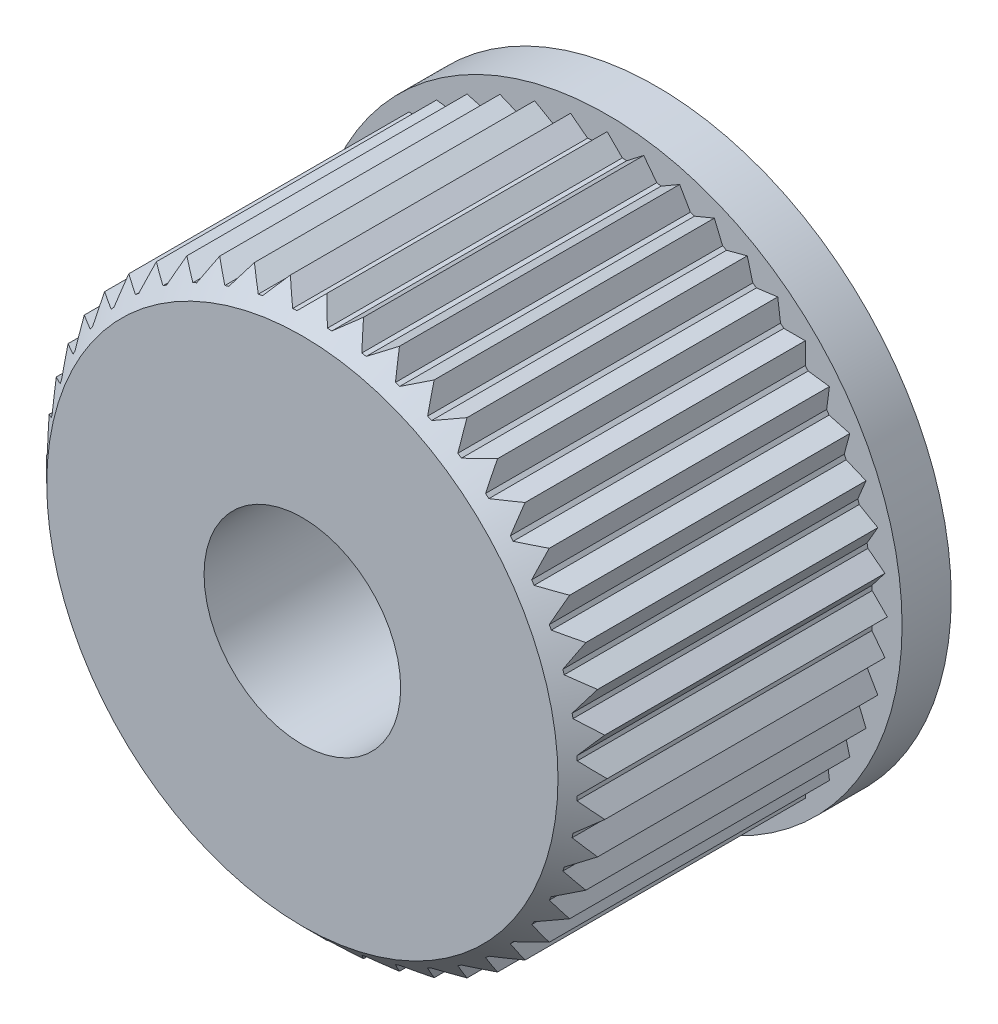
from build123d import *

# Parameters (mm, degrees)
ESQUISSE1_R             = 3
BOSS_EXTRU_1_DEPTH      = 0.5
BOSS_EXTRU_2_DEPTH      = 3.6
ESQUISSE3_R             = 1
ENL_V_MAT_EXTRU_1_DEPTH = 6.564171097


with BuildPart() as part:
    # Esquisse1 → Boss.-Extru.1 (new body)
    with BuildSketch(Plane.XY):
        Circle(ESQUISSE1_R)
    extrude(amount=BOSS_EXTRU_1_DEPTH)

    # Esquisse2 → Boss.-Extru.2 (add)
    with BuildSketch(Plane.XY):
        with BuildLine():
            Line((0, 2.85), (-0.154419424, 2.695580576))
            ThreePointArc((-0.154419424, 2.695580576), (-0.176588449, 2.694219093), (-0.198745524, 2.69267529))
            Line((-0.198745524, 2.69267529), (-0.371999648, 2.825617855))
            Line((-0.371999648, 2.825617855), (-0.504942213, 2.652363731))
            ThreePointArc((-0.504942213, 2.652363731), (-0.526743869, 2.648120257), (-0.548509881, 2.643697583))
            Line((-0.548509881, 2.643697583), (-0.737634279, 2.752888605))
            Line((-0.737634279, 2.752888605), (-0.8468253, 2.563764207))
            ThreePointArc((-0.8468253, 2.563764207), (-0.867886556, 2.55671135), (-0.888889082, 2.549485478))
            Line((-0.888889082, 2.549485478), (-1.090647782, 2.633056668))
            Line((-1.090647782, 2.633056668), (-1.174218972, 2.431297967))
            ThreePointArc((-1.174218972, 2.431297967), (-1.194179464, 2.421556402), (-1.214059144, 2.411650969))
            Line((-1.214059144, 2.411650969), (-1.425, 2.468172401))
            Line((-1.425, 2.468172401), (-1.481521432, 2.257231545))
            ThreePointArc((-1.481521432, 2.257231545), (-1.500039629, 2.244967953), (-1.518456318, 2.232552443))
            Line((-1.518456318, 2.232552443), (-1.734970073, 2.26105702))
            Line((-1.734970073, 2.26105702), (-1.763474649, 2.044543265))
            ThreePointArc((-1.763474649, 2.044543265), (-1.780233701, 2.02996748), (-1.796872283, 2.015254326))
            Line((-1.796872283, 2.015254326), (-2.015254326, 2.015254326))
            Line((-2.015254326, 2.015254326), (-2.015254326, 1.796872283))
            ThreePointArc((-2.015254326, 1.796872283), (-2.02996748, 1.780233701), (-2.044543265, 1.763474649))
            Line((-2.044543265, 1.763474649), (-2.26105702, 1.734970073))
            Line((-2.26105702, 1.734970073), (-2.232552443, 1.518456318))
            ThreePointArc((-2.232552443, 1.518456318), (-2.244967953, 1.500039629), (-2.257231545, 1.481521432))
            Line((-2.257231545, 1.481521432), (-2.468172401, 1.425))
            Line((-2.468172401, 1.425), (-2.411650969, 1.214059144))
            ThreePointArc((-2.411650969, 1.214059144), (-2.421556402, 1.194179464), (-2.431297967, 1.174218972))
            Line((-2.431297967, 1.174218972), (-2.633056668, 1.090647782))
            Line((-2.633056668, 1.090647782), (-2.549485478, 0.888889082))
            ThreePointArc((-2.549485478, 0.888889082), (-2.55671135, 0.867886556), (-2.563764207, 0.8468253))
            Line((-2.563764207, 0.8468253), (-2.752888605, 0.737634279))
            Line((-2.752888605, 0.737634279), (-2.643697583, 0.548509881))
            ThreePointArc((-2.643697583, 0.548509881), (-2.648120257, 0.526743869), (-2.652363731, 0.504942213))
            Line((-2.652363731, 0.504942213), (-2.825617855, 0.371999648))
            Line((-2.825617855, 0.371999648), (-2.69267529, 0.198745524))
            ThreePointArc((-2.69267529, 0.198745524), (-2.694219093, 0.176588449), (-2.695580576, 0.154419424))
            Line((-2.695580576, 0.154419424), (-2.85, 0))
            Line((-2.85, 0), (-2.695580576, -0.154419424))
            ThreePointArc((-2.695580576, -0.154419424), (-2.694219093, -0.176588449), (-2.69267529, -0.198745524))
            Line((-2.69267529, -0.198745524), (-2.825617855, -0.371999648))
            Line((-2.825617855, -0.371999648), (-2.652363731, -0.504942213))
            ThreePointArc((-2.652363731, -0.504942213), (-2.648120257, -0.526743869), (-2.643697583, -0.548509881))
            Line((-2.643697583, -0.548509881), (-2.752888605, -0.737634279))
            Line((-2.752888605, -0.737634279), (-2.563764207, -0.8468253))
            ThreePointArc((-2.563764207, -0.8468253), (-2.55671135, -0.867886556), (-2.549485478, -0.888889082))
            Line((-2.549485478, -0.888889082), (-2.633056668, -1.090647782))
            Line((-2.633056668, -1.090647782), (-2.431297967, -1.174218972))
            ThreePointArc((-2.431297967, -1.174218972), (-2.421556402, -1.194179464), (-2.411650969, -1.214059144))
            Line((-2.411650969, -1.214059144), (-2.468172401, -1.425))
            Line((-2.468172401, -1.425), (-2.257231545, -1.481521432))
            ThreePointArc((-2.257231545, -1.481521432), (-2.244967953, -1.500039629), (-2.232552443, -1.518456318))
            Line((-2.232552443, -1.518456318), (-2.26105702, -1.734970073))
            Line((-2.26105702, -1.734970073), (-2.044543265, -1.763474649))
            ThreePointArc((-2.044543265, -1.763474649), (-2.02996748, -1.780233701), (-2.015254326, -1.796872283))
            Line((-2.015254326, -1.796872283), (-2.015254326, -2.015254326))
            Line((-2.015254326, -2.015254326), (-1.796872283, -2.015254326))
            ThreePointArc((-1.796872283, -2.015254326), (-1.780233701, -2.02996748), (-1.763474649, -2.044543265))
            Line((-1.763474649, -2.044543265), (-1.734970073, -2.26105702))
            Line((-1.734970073, -2.26105702), (-1.518456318, -2.232552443))
            ThreePointArc((-1.518456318, -2.232552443), (-1.500039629, -2.244967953), (-1.481521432, -2.257231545))
            Line((-1.481521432, -2.257231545), (-1.425, -2.468172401))
            Line((-1.425, -2.468172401), (-1.214059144, -2.411650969))
            ThreePointArc((-1.214059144, -2.411650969), (-1.194179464, -2.421556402), (-1.174218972, -2.431297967))
            Line((-1.174218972, -2.431297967), (-1.090647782, -2.633056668))
            Line((-1.090647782, -2.633056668), (-0.888889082, -2.549485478))
            ThreePointArc((-0.888889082, -2.549485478), (-0.867886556, -2.55671135), (-0.8468253, -2.563764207))
            Line((-0.8468253, -2.563764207), (-0.737634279, -2.752888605))
            Line((-0.737634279, -2.752888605), (-0.548509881, -2.643697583))
            ThreePointArc((-0.548509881, -2.643697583), (-0.526743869, -2.648120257), (-0.504942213, -2.652363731))
            Line((-0.504942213, -2.652363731), (-0.371999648, -2.825617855))
            Line((-0.371999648, -2.825617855), (-0.198745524, -2.69267529))
            ThreePointArc((-0.198745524, -2.69267529), (-0.176588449, -2.694219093), (-0.154419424, -2.695580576))
            Line((-0.154419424, -2.695580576), (0, -2.85))
            Line((0, -2.85), (0.154419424, -2.695580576))
            ThreePointArc((0.154419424, -2.695580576), (0.176588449, -2.694219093), (0.198745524, -2.69267529))
            Line((0.198745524, -2.69267529), (0.371999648, -2.825617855))
            Line((0.371999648, -2.825617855), (0.504942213, -2.652363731))
            ThreePointArc((0.504942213, -2.652363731), (0.526743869, -2.648120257), (0.548509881, -2.643697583))
            Line((0.548509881, -2.643697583), (0.737634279, -2.752888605))
            Line((0.737634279, -2.752888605), (0.8468253, -2.563764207))
            ThreePointArc((0.8468253, -2.563764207), (0.867886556, -2.55671135), (0.888889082, -2.549485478))
            Line((0.888889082, -2.549485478), (1.090647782, -2.633056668))
            Line((1.090647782, -2.633056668), (1.174218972, -2.431297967))
            ThreePointArc((1.174218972, -2.431297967), (1.194179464, -2.421556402), (1.214059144, -2.411650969))
            Line((1.214059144, -2.411650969), (1.425, -2.468172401))
            Line((1.425, -2.468172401), (1.481521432, -2.257231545))
            ThreePointArc((1.481521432, -2.257231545), (1.500039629, -2.244967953), (1.518456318, -2.232552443))
            Line((1.518456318, -2.232552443), (1.734970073, -2.26105702))
            Line((1.734970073, -2.26105702), (1.763474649, -2.044543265))
            ThreePointArc((1.763474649, -2.044543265), (1.780233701, -2.02996748), (1.796872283, -2.015254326))
            Line((1.796872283, -2.015254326), (2.015254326, -2.015254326))
            Line((2.015254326, -2.015254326), (2.015254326, -1.796872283))
            ThreePointArc((2.015254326, -1.796872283), (2.02996748, -1.780233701), (2.044543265, -1.763474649))
            Line((2.044543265, -1.763474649), (2.26105702, -1.734970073))
            Line((2.26105702, -1.734970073), (2.232552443, -1.518456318))
            ThreePointArc((2.232552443, -1.518456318), (2.244967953, -1.500039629), (2.257231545, -1.481521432))
            Line((2.257231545, -1.481521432), (2.468172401, -1.425))
            Line((2.468172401, -1.425), (2.411650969, -1.214059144))
            ThreePointArc((2.411650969, -1.214059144), (2.421556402, -1.194179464), (2.431297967, -1.174218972))
            Line((2.431297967, -1.174218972), (2.633056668, -1.090647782))
            Line((2.633056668, -1.090647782), (2.549485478, -0.888889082))
            ThreePointArc((2.549485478, -0.888889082), (2.55671135, -0.867886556), (2.563764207, -0.8468253))
            Line((2.563764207, -0.8468253), (2.752888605, -0.737634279))
            Line((2.752888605, -0.737634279), (2.643697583, -0.548509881))
            ThreePointArc((2.643697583, -0.548509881), (2.648120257, -0.526743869), (2.652363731, -0.504942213))
            Line((2.652363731, -0.504942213), (2.825617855, -0.371999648))
            Line((2.825617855, -0.371999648), (2.69267529, -0.198745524))
            ThreePointArc((2.69267529, -0.198745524), (2.694219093, -0.176588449), (2.695580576, -0.154419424))
            Line((2.695580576, -0.154419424), (2.85, 0))
            Line((2.85, 0), (2.695580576, 0.154419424))
            ThreePointArc((2.695580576, 0.154419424), (2.694219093, 0.176588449), (2.69267529, 0.198745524))
            Line((2.69267529, 0.198745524), (2.825617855, 0.371999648))
            Line((2.825617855, 0.371999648), (2.652363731, 0.504942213))
            ThreePointArc((2.652363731, 0.504942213), (2.648120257, 0.526743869), (2.643697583, 0.548509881))
            Line((2.643697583, 0.548509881), (2.752888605, 0.737634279))
            Line((2.752888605, 0.737634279), (2.563764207, 0.8468253))
            ThreePointArc((2.563764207, 0.8468253), (2.55671135, 0.867886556), (2.549485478, 0.888889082))
            Line((2.549485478, 0.888889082), (2.633056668, 1.090647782))
            Line((2.633056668, 1.090647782), (2.431297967, 1.174218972))
            ThreePointArc((2.431297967, 1.174218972), (2.421556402, 1.194179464), (2.411650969, 1.214059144))
            Line((2.411650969, 1.214059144), (2.468172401, 1.425))
            Line((2.468172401, 1.425), (2.257231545, 1.481521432))
            ThreePointArc((2.257231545, 1.481521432), (2.244967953, 1.500039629), (2.232552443, 1.518456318))
            Line((2.232552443, 1.518456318), (2.26105702, 1.734970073))
            Line((2.26105702, 1.734970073), (2.044543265, 1.763474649))
            ThreePointArc((2.044543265, 1.763474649), (2.02996748, 1.780233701), (2.015254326, 1.796872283))
            Line((2.015254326, 1.796872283), (2.015254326, 2.015254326))
            Line((2.015254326, 2.015254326), (1.796872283, 2.015254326))
            ThreePointArc((1.796872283, 2.015254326), (1.780233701, 2.02996748), (1.763474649, 2.044543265))
            Line((1.763474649, 2.044543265), (1.734970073, 2.26105702))
            Line((1.734970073, 2.26105702), (1.518456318, 2.232552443))
            ThreePointArc((1.518456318, 2.232552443), (1.500039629, 2.244967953), (1.481521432, 2.257231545))
            Line((1.481521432, 2.257231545), (1.425, 2.468172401))
            Line((1.425, 2.468172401), (1.214059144, 2.411650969))
            ThreePointArc((1.214059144, 2.411650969), (1.194179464, 2.421556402), (1.174218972, 2.431297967))
            Line((1.174218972, 2.431297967), (1.090647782, 2.633056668))
            Line((1.090647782, 2.633056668), (0.888889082, 2.549485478))
            ThreePointArc((0.888889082, 2.549485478), (0.867886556, 2.55671135), (0.8468253, 2.563764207))
            Line((0.8468253, 2.563764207), (0.737634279, 2.752888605))
            Line((0.737634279, 2.752888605), (0.548509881, 2.643697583))
            ThreePointArc((0.548509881, 2.643697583), (0.526743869, 2.648120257), (0.504942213, 2.652363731))
            Line((0.504942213, 2.652363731), (0.371999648, 2.825617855))
            Line((0.371999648, 2.825617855), (0.198745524, 2.69267529))
            ThreePointArc((0.198745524, 2.69267529), (0.176588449, 2.694219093), (0.154419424, 2.695580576))
            Line((0.154419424, 2.695580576), (0, 2.85))
        make_face()
    extrude(amount=BOSS_EXTRU_2_DEPTH)

    # Esquisse3 → Enl_v. mat.-Extru.1 (cut, through all)
    with BuildSketch(Plane.XY.offset(3.6)):
        Circle(ESQUISSE3_R)
    extrude(amount=-ENL_V_MAT_EXTRU_1_DEPTH, mode=Mode.SUBTRACT)

    # Esquisse4 → Enl_vement de mati_re-R_volution1 (revolve, cut)
    with BuildSketch(Plane(origin=(0, 0, 0), x_dir=(0, 0, -1), z_dir=(1, 0, 0)), mode=Mode.PRIVATE) as enl_vement_de_mati_re_r_volution1_sk:
        Polygon((-3.6, 2.6), (-3.2, 3), (-3.6, 3), align=None)
    revolve(enl_vement_de_mati_re_r_volution1_sk.sketch.rotate(Axis((0, 0, 0), (0, 0, 1)), 90), axis=Axis((0, 0, 0), (0, 0, 1)), mode=Mode.SUBTRACT)


solid = part.part
